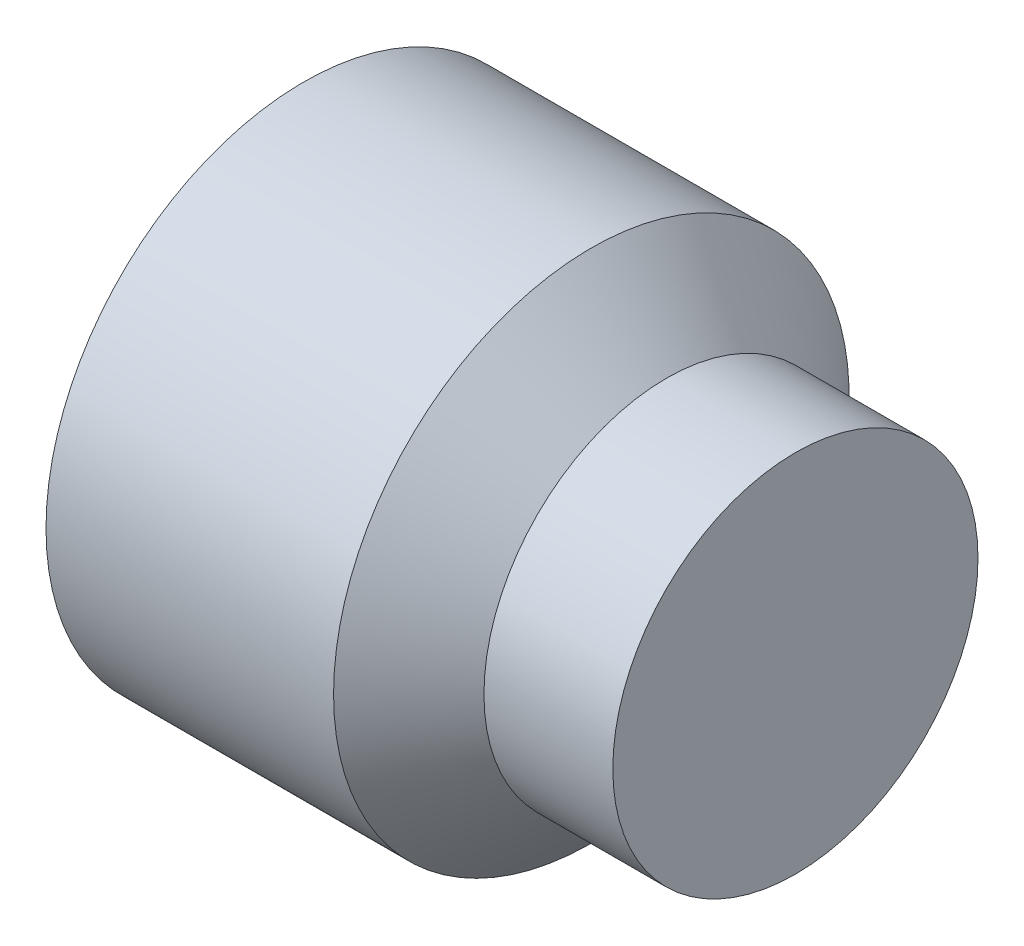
ISO-10303-21;
HEADER;
FILE_DESCRIPTION(('STEP AP214'),'2;1');
FILE_NAME('part.step','',(''),(''),'','','');
FILE_SCHEMA(('AUTOMOTIVE_DESIGN { 1 0 10303 214 1 1 1 1 }'));
ENDSEC;
DATA;
#1=APPLICATION_CONTEXT('core data for automotive mechanical design processes');
#2=APPLICATION_PROTOCOL_DEFINITION('international standard','automotive_design',2000,#1);
#3=PRODUCT_CONTEXT('',#1,'mechanical');
#4=PRODUCT('Part','Part','',(#3));
#5=PRODUCT_RELATED_PRODUCT_CATEGORY('part','',(#4));
#6=PRODUCT_DEFINITION_FORMATION('','',#4);
#7=PRODUCT_DEFINITION_CONTEXT('part definition',#1,'design');
#8=PRODUCT_DEFINITION('design','',#6,#7);
#9=PRODUCT_DEFINITION_SHAPE('','',#8);
#10=(LENGTH_UNIT() NAMED_UNIT(*) SI_UNIT(.MILLI.,.METRE.));
#11=(NAMED_UNIT(*) PLANE_ANGLE_UNIT() SI_UNIT($,.RADIAN.));
#12=(NAMED_UNIT(*) SI_UNIT($,.STERADIAN.) SOLID_ANGLE_UNIT());
#13=UNCERTAINTY_MEASURE_WITH_UNIT(LENGTH_MEASURE(1.E-05),#10,'distance_accuracy_value','');
#14=(GEOMETRIC_REPRESENTATION_CONTEXT(3) GLOBAL_UNCERTAINTY_ASSIGNED_CONTEXT((#13)) GLOBAL_UNIT_ASSIGNED_CONTEXT((#10,
#11,#12)) REPRESENTATION_CONTEXT('',''));
#15=CARTESIAN_POINT('',(0.,0.,0.));
#16=DIRECTION('',(0.,0.,1.));
#17=DIRECTION('',(1.,0.,0.));
#18=AXIS2_PLACEMENT_3D('',#15,#16,#17);
#19=CARTESIAN_POINT('',(0.,0.,0.));
#20=DIRECTION('',(1.,0.,0.));
#21=DIRECTION('',(0.,0.,-1.));
#22=AXIS2_PLACEMENT_3D('',#19,#20,#21);
#23=PLANE('',#22);
#24=CARTESIAN_POINT('',(0.,0.,0.));
#25=DIRECTION('',(-1.,0.,0.));
#26=DIRECTION('',(0.,0.,1.));
#27=AXIS2_PLACEMENT_3D('',#24,#25,#26);
#28=CIRCLE('',#27,5.036);
#29=CARTESIAN_POINT('',(0.,0.,5.036));
#30=VERTEX_POINT('',#29);
#31=EDGE_CURVE('E11',#30,#30,#28,.T.);
#32=ORIENTED_EDGE('',*,*,#31,.T.);
#33=EDGE_LOOP('',(#32));
#34=FACE_BOUND('',#33,.T.);
#35=DIRECTION('',(0.,0.5,0.866025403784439));
#36=VECTOR('',#35,1.);
#37=CARTESIAN_POINT('',(0.,1.73205080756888,-3.));
#38=LINE('',#37,#36);
#39=CARTESIAN_POINT('',(0.,1.73205080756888,-3.));
#40=VERTEX_POINT('',#39);
#41=CARTESIAN_POINT('',(0.,3.46410161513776,0.));
#42=VERTEX_POINT('',#41);
#43=EDGE_CURVE('E46',#40,#42,#38,.T.);
#44=ORIENTED_EDGE('',*,*,#43,.T.);
#45=DIRECTION('',(0.,-0.5,0.866025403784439));
#46=VECTOR('',#45,1.);
#47=CARTESIAN_POINT('',(0.,3.46410161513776,0.));
#48=LINE('',#47,#46);
#49=CARTESIAN_POINT('',(0.,1.73205080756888,3.));
#50=VERTEX_POINT('',#49);
#51=EDGE_CURVE('E117',#42,#50,#48,.T.);
#52=ORIENTED_EDGE('',*,*,#51,.T.);
#53=DIRECTION('',(0.,-1.,0.));
#54=VECTOR('',#53,1.);
#55=CARTESIAN_POINT('',(0.,1.73205080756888,3.));
#56=LINE('',#55,#54);
#57=CARTESIAN_POINT('',(0.,-1.73205080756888,3.));
#58=VERTEX_POINT('',#57);
#59=EDGE_CURVE('E120',#50,#58,#56,.T.);
#60=ORIENTED_EDGE('',*,*,#59,.T.);
#61=DIRECTION('',(0.,-0.5,-0.866025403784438));
#62=VECTOR('',#61,1.);
#63=CARTESIAN_POINT('',(0.,-1.73205080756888,3.));
#64=LINE('',#63,#62);
#65=CARTESIAN_POINT('',(0.,-3.46410161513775,0.));
#66=VERTEX_POINT('',#65);
#67=EDGE_CURVE('E123',#58,#66,#64,.T.);
#68=ORIENTED_EDGE('',*,*,#67,.T.);
#69=DIRECTION('',(0.,0.5,-0.866025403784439));
#70=VECTOR('',#69,1.);
#71=CARTESIAN_POINT('',(0.,-3.46410161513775,0.));
#72=LINE('',#71,#70);
#73=CARTESIAN_POINT('',(0.,-1.73205080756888,-3.));
#74=VERTEX_POINT('',#73);
#75=EDGE_CURVE('E107',#66,#74,#72,.T.);
#76=ORIENTED_EDGE('',*,*,#75,.T.);
#77=DIRECTION('',(0.,1.,0.));
#78=VECTOR('',#77,1.);
#79=CARTESIAN_POINT('',(0.,-1.73205080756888,-3.));
#80=LINE('',#79,#78);
#81=EDGE_CURVE('E126',#74,#40,#80,.T.);
#82=ORIENTED_EDGE('',*,*,#81,.T.);
#83=EDGE_LOOP('',(#44,#52,#60,#68,#76,#82));
#84=FACE_BOUND('',#83,.T.);
#85=ADVANCED_FACE('F32',(#34,#84),#23,.F.);
#86=CARTESIAN_POINT('',(0.556565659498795,0.,0.));
#87=DIRECTION('',(1.,0.,0.));
#88=DIRECTION('',(0.,0.,-1.));
#89=AXIS2_PLACEMENT_3D('',#86,#87,#88);
#90=CONICAL_SURFACE('',#89,6.,1.0471975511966);
#91=ORIENTED_EDGE('',*,*,#31,.F.);
#92=EDGE_LOOP('',(#91));
#93=FACE_BOUND('',#92,.T.);
#94=CARTESIAN_POINT('',(0.556565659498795,0.,0.));
#95=DIRECTION('',(-1.,0.,0.));
#96=DIRECTION('',(0.,0.,1.));
#97=AXIS2_PLACEMENT_3D('',#94,#95,#96);
#98=CIRCLE('',#97,6.);
#99=CARTESIAN_POINT('',(0.556565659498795,0.,6.));
#100=VERTEX_POINT('',#99);
#101=EDGE_CURVE('E39',#100,#100,#98,.T.);
#102=ORIENTED_EDGE('',*,*,#101,.T.);
#103=EDGE_LOOP('',(#102));
#104=FACE_BOUND('',#103,.T.);
#105=ADVANCED_FACE('F148',(#93,#104),#90,.T.);
#106=CARTESIAN_POINT('',(0.,0.,0.));
#107=DIRECTION('',(-1.,0.,0.));
#108=DIRECTION('',(0.,0.,1.));
#109=AXIS2_PLACEMENT_3D('',#106,#107,#108);
#110=CYLINDRICAL_SURFACE('',#109,6.);
#111=ORIENTED_EDGE('',*,*,#101,.F.);
#112=EDGE_LOOP('',(#111));
#113=FACE_BOUND('',#112,.T.);
#114=CARTESIAN_POINT('',(7.24999999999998,0.,0.));
#115=DIRECTION('',(-1.,0.,0.));
#116=DIRECTION('',(0.,0.,1.));
#117=AXIS2_PLACEMENT_3D('',#114,#115,#116);
#118=CIRCLE('',#117,6.);
#119=CARTESIAN_POINT('',(7.24999999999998,0.,6.));
#120=VERTEX_POINT('',#119);
#121=EDGE_CURVE('E143',#120,#120,#118,.T.);
#122=ORIENTED_EDGE('',*,*,#121,.T.);
#123=EDGE_LOOP('',(#122));
#124=FACE_BOUND('',#123,.T.);
#125=ADVANCED_FACE('F150',(#113,#124),#110,.T.);
#126=CARTESIAN_POINT('',(9.,0.,0.));
#127=DIRECTION('',(-1.,0.,0.));
#128=DIRECTION('',(0.,0.,1.));
#129=AXIS2_PLACEMENT_3D('',#126,#127,#128);
#130=CONICAL_SURFACE('',#129,4.25,0.785398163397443);
#131=ORIENTED_EDGE('',*,*,#121,.F.);
#132=EDGE_LOOP('',(#131));
#133=FACE_BOUND('',#132,.T.);
#134=CARTESIAN_POINT('',(9.,0.,0.));
#135=DIRECTION('',(-1.,0.,0.));
#136=DIRECTION('',(0.,0.,1.));
#137=AXIS2_PLACEMENT_3D('',#134,#135,#136);
#138=CIRCLE('',#137,4.25);
#139=CARTESIAN_POINT('',(9.,0.,4.25));
#140=VERTEX_POINT('',#139);
#141=EDGE_CURVE('E140',#140,#140,#138,.T.);
#142=ORIENTED_EDGE('',*,*,#141,.T.);
#143=EDGE_LOOP('',(#142));
#144=FACE_BOUND('',#143,.T.);
#145=ADVANCED_FACE('F153',(#133,#144),#130,.T.);
#146=CARTESIAN_POINT('',(0.,0.,0.));
#147=DIRECTION('',(-1.,0.,0.));
#148=DIRECTION('',(0.,0.,1.));
#149=AXIS2_PLACEMENT_3D('',#146,#147,#148);
#150=CYLINDRICAL_SURFACE('',#149,4.25);
#151=ORIENTED_EDGE('',*,*,#141,.F.);
#152=EDGE_LOOP('',(#151));
#153=FACE_BOUND('',#152,.T.);
#154=CARTESIAN_POINT('',(12.,0.,0.));
#155=DIRECTION('',(-1.,0.,0.));
#156=DIRECTION('',(0.,0.,1.));
#157=AXIS2_PLACEMENT_3D('',#154,#155,#156);
#158=CIRCLE('',#157,4.25);
#159=CARTESIAN_POINT('',(12.,0.,4.25));
#160=VERTEX_POINT('',#159);
#161=EDGE_CURVE('E137',#160,#160,#158,.T.);
#162=ORIENTED_EDGE('',*,*,#161,.T.);
#163=EDGE_LOOP('',(#162));
#164=FACE_BOUND('',#163,.T.);
#165=ADVANCED_FACE('F159',(#153,#164),#150,.T.);
#166=CARTESIAN_POINT('',(12.,4.25,0.));
#167=DIRECTION('',(-1.,0.,0.));
#168=DIRECTION('',(0.,0.,1.));
#169=AXIS2_PLACEMENT_3D('',#166,#167,#168);
#170=PLANE('',#169);
#171=ORIENTED_EDGE('',*,*,#161,.F.);
#172=EDGE_LOOP('',(#171));
#173=FACE_BOUND('',#172,.T.);
#174=ADVANCED_FACE('F165',(#173),#170,.F.);
#175=CARTESIAN_POINT('',(4.8,1.73205080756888,-3.));
#176=DIRECTION('',(0.,-0.866025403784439,0.5));
#177=DIRECTION('',(0.,-0.5,-0.866025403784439));
#178=AXIS2_PLACEMENT_3D('',#175,#176,#177);
#179=PLANE('',#178);
#180=ORIENTED_EDGE('',*,*,#43,.F.);
#181=DIRECTION('',(-1.,0.,0.));
#182=VECTOR('',#181,1.);
#183=CARTESIAN_POINT('',(4.8,1.73205080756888,-3.));
#184=LINE('',#183,#182);
#185=CARTESIAN_POINT('',(4.8,1.73205080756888,-3.));
#186=VERTEX_POINT('',#185);
#187=EDGE_CURVE('E112',#186,#40,#184,.T.);
#188=ORIENTED_EDGE('',*,*,#187,.F.);
#189=DIRECTION('',(0.,0.5,0.866025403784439));
#190=VECTOR('',#189,1.);
#191=CARTESIAN_POINT('',(4.8,1.73205080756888,-3.));
#192=LINE('',#191,#190);
#193=CARTESIAN_POINT('',(4.8,3.46410161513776,0.));
#194=VERTEX_POINT('',#193);
#195=EDGE_CURVE('E129',#186,#194,#192,.T.);
#196=ORIENTED_EDGE('',*,*,#195,.T.);
#197=DIRECTION('',(-1.,0.,0.));
#198=VECTOR('',#197,1.);
#199=CARTESIAN_POINT('',(4.8,3.46410161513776,0.));
#200=LINE('',#199,#198);
#201=EDGE_CURVE('E135',#194,#42,#200,.T.);
#202=ORIENTED_EDGE('',*,*,#201,.T.);
#203=EDGE_LOOP('',(#180,#188,#196,#202));
#204=FACE_BOUND('',#203,.T.);
#205=ADVANCED_FACE('F170',(#204),#179,.T.);
#206=CARTESIAN_POINT('',(4.8,3.46410161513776,0.));
#207=DIRECTION('',(0.,-0.866025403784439,-0.5));
#208=DIRECTION('',(0.,0.5,-0.866025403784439));
#209=AXIS2_PLACEMENT_3D('',#206,#207,#208);
#210=PLANE('',#209);
#211=ORIENTED_EDGE('',*,*,#51,.F.);
#212=ORIENTED_EDGE('',*,*,#201,.F.);
#213=DIRECTION('',(0.,-0.5,0.866025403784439));
#214=VECTOR('',#213,1.);
#215=CARTESIAN_POINT('',(4.8,3.46410161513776,0.));
#216=LINE('',#215,#214);
#217=CARTESIAN_POINT('',(4.8,1.73205080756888,3.));
#218=VERTEX_POINT('',#217);
#219=EDGE_CURVE('E85',#194,#218,#216,.T.);
#220=ORIENTED_EDGE('',*,*,#219,.T.);
#221=DIRECTION('',(-1.,0.,0.));
#222=VECTOR('',#221,1.);
#223=CARTESIAN_POINT('',(4.8,1.73205080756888,3.));
#224=LINE('',#223,#222);
#225=EDGE_CURVE('E133',#218,#50,#224,.T.);
#226=ORIENTED_EDGE('',*,*,#225,.T.);
#227=EDGE_LOOP('',(#211,#212,#220,#226));
#228=FACE_BOUND('',#227,.T.);
#229=ADVANCED_FACE('F175',(#228),#210,.T.);
#230=CARTESIAN_POINT('',(4.8,1.73205080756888,3.));
#231=DIRECTION('',(0.,0.,-1.));
#232=DIRECTION('',(-1.,0.,0.));
#233=AXIS2_PLACEMENT_3D('',#230,#231,#232);
#234=PLANE('',#233);
#235=ORIENTED_EDGE('',*,*,#59,.F.);
#236=ORIENTED_EDGE('',*,*,#225,.F.);
#237=DIRECTION('',(0.,-1.,0.));
#238=VECTOR('',#237,1.);
#239=CARTESIAN_POINT('',(4.8,1.73205080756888,3.));
#240=LINE('',#239,#238);
#241=CARTESIAN_POINT('',(4.8,-1.73205080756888,3.));
#242=VERTEX_POINT('',#241);
#243=EDGE_CURVE('E103',#218,#242,#240,.T.);
#244=ORIENTED_EDGE('',*,*,#243,.T.);
#245=DIRECTION('',(-1.,0.,0.));
#246=VECTOR('',#245,1.);
#247=CARTESIAN_POINT('',(4.8,-1.73205080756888,3.));
#248=LINE('',#247,#246);
#249=EDGE_CURVE('E100',#242,#58,#248,.T.);
#250=ORIENTED_EDGE('',*,*,#249,.T.);
#251=EDGE_LOOP('',(#235,#236,#244,#250));
#252=FACE_BOUND('',#251,.T.);
#253=ADVANCED_FACE('F192',(#252),#234,.T.);
#254=CARTESIAN_POINT('',(4.8,-1.73205080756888,3.));
#255=DIRECTION('',(0.,0.866025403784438,-0.5));
#256=DIRECTION('',(0.,0.5,0.866025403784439));
#257=AXIS2_PLACEMENT_3D('',#254,#255,#256);
#258=PLANE('',#257);
#259=ORIENTED_EDGE('',*,*,#67,.F.);
#260=ORIENTED_EDGE('',*,*,#249,.F.);
#261=DIRECTION('',(0.,-0.5,-0.866025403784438));
#262=VECTOR('',#261,1.);
#263=CARTESIAN_POINT('',(4.8,-1.73205080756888,3.));
#264=LINE('',#263,#262);
#265=CARTESIAN_POINT('',(4.8,-3.46410161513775,0.));
#266=VERTEX_POINT('',#265);
#267=EDGE_CURVE('E95',#242,#266,#264,.T.);
#268=ORIENTED_EDGE('',*,*,#267,.T.);
#269=DIRECTION('',(-1.,0.,0.));
#270=VECTOR('',#269,1.);
#271=CARTESIAN_POINT('',(4.8,-3.46410161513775,0.));
#272=LINE('',#271,#270);
#273=EDGE_CURVE('E99',#266,#66,#272,.T.);
#274=ORIENTED_EDGE('',*,*,#273,.T.);
#275=EDGE_LOOP('',(#259,#260,#268,#274));
#276=FACE_BOUND('',#275,.T.);
#277=ADVANCED_FACE('F98',(#276),#258,.T.);
#278=CARTESIAN_POINT('',(4.8,-3.46410161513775,0.));
#279=DIRECTION('',(0.,0.866025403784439,0.5));
#280=DIRECTION('',(0.,-0.5,0.866025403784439));
#281=AXIS2_PLACEMENT_3D('',#278,#279,#280);
#282=PLANE('',#281);
#283=ORIENTED_EDGE('',*,*,#75,.F.);
#284=ORIENTED_EDGE('',*,*,#273,.F.);
#285=DIRECTION('',(0.,0.5,-0.866025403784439));
#286=VECTOR('',#285,1.);
#287=CARTESIAN_POINT('',(4.8,-3.46410161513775,0.));
#288=LINE('',#287,#286);
#289=CARTESIAN_POINT('',(4.8,-1.73205080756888,-3.));
#290=VERTEX_POINT('',#289);
#291=EDGE_CURVE('E102',#266,#290,#288,.T.);
#292=ORIENTED_EDGE('',*,*,#291,.T.);
#293=DIRECTION('',(-1.,0.,0.));
#294=VECTOR('',#293,1.);
#295=CARTESIAN_POINT('',(4.8,-1.73205080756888,-3.));
#296=LINE('',#295,#294);
#297=EDGE_CURVE('E76',#290,#74,#296,.T.);
#298=ORIENTED_EDGE('',*,*,#297,.T.);
#299=EDGE_LOOP('',(#283,#284,#292,#298));
#300=FACE_BOUND('',#299,.T.);
#301=ADVANCED_FACE('F105',(#300),#282,.T.);
#302=CARTESIAN_POINT('',(4.8,-1.73205080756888,-3.));
#303=DIRECTION('',(0.,0.,1.));
#304=DIRECTION('',(1.,0.,0.));
#305=AXIS2_PLACEMENT_3D('',#302,#303,#304);
#306=PLANE('',#305);
#307=ORIENTED_EDGE('',*,*,#81,.F.);
#308=ORIENTED_EDGE('',*,*,#297,.F.);
#309=DIRECTION('',(0.,1.,0.));
#310=VECTOR('',#309,1.);
#311=CARTESIAN_POINT('',(4.8,-1.73205080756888,-3.));
#312=LINE('',#311,#310);
#313=EDGE_CURVE('E54',#290,#186,#312,.T.);
#314=ORIENTED_EDGE('',*,*,#313,.T.);
#315=ORIENTED_EDGE('',*,*,#187,.T.);
#316=EDGE_LOOP('',(#307,#308,#314,#315));
#317=FACE_BOUND('',#316,.T.);
#318=ADVANCED_FACE('F185',(#317),#306,.T.);
#319=CARTESIAN_POINT('',(4.8,5.19615242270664,3.));
#320=DIRECTION('',(1.,0.,0.));
#321=DIRECTION('',(0.,0.,-1.));
#322=AXIS2_PLACEMENT_3D('',#319,#320,#321);
#323=PLANE('',#322);
#324=ORIENTED_EDGE('',*,*,#195,.F.);
#325=ORIENTED_EDGE('',*,*,#313,.F.);
#326=ORIENTED_EDGE('',*,*,#291,.F.);
#327=ORIENTED_EDGE('',*,*,#267,.F.);
#328=ORIENTED_EDGE('',*,*,#243,.F.);
#329=ORIENTED_EDGE('',*,*,#219,.F.);
#330=EDGE_LOOP('',(#324,#325,#326,#327,#328,#329));
#331=FACE_BOUND('',#330,.T.);
#332=ADVANCED_FACE('F110',(#331),#323,.F.);
#333=CLOSED_SHELL('',(#85,#105,#125,#145,#165,#174,#205,#229,#253,#277,#301,#318,#332));
#334=MANIFOLD_SOLID_BREP('B2',#333);
#335=ADVANCED_BREP_SHAPE_REPRESENTATION('',(#18,#334),#14);
#336=SHAPE_DEFINITION_REPRESENTATION(#9,#335);
ENDSEC;
END-ISO-10303-21;
